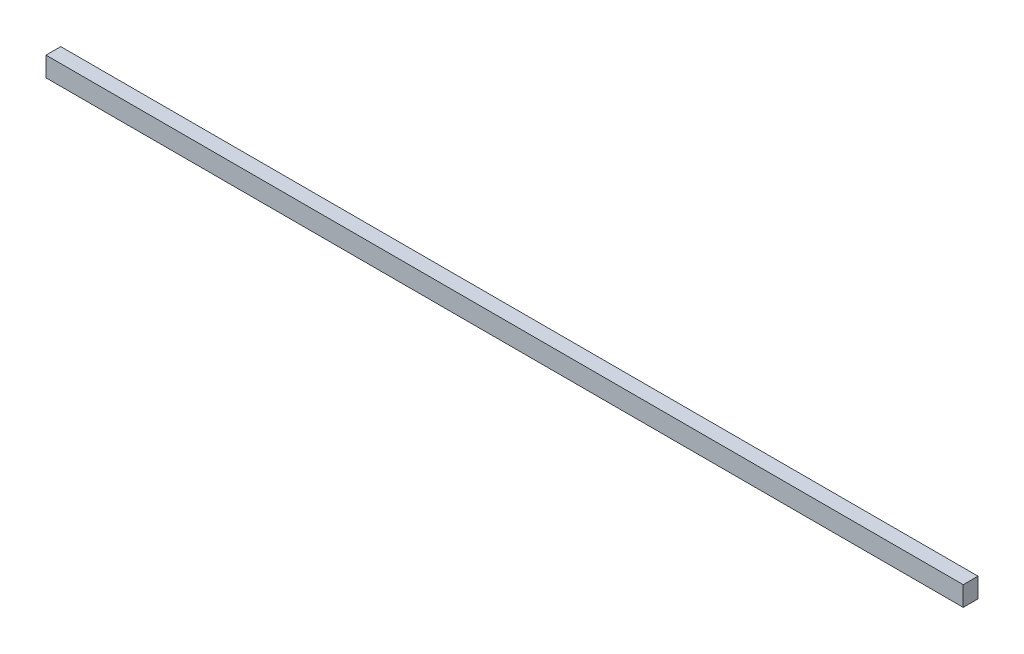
from build123d import *

# Parameters (mm, degrees)
SKETCH1_W      = 236.728
SKETCH1_H      = 5.08
EXTRUDE1_DEPTH = 3.81


with BuildPart() as part:
    # Sketch1 → Extrude1 (new body)
    with BuildSketch(Plane.XY):
        with Locations((46.658643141, 34.785549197)):
            Rectangle(SKETCH1_W, SKETCH1_H)
    extrude(amount=EXTRUDE1_DEPTH)


solid = part.part
